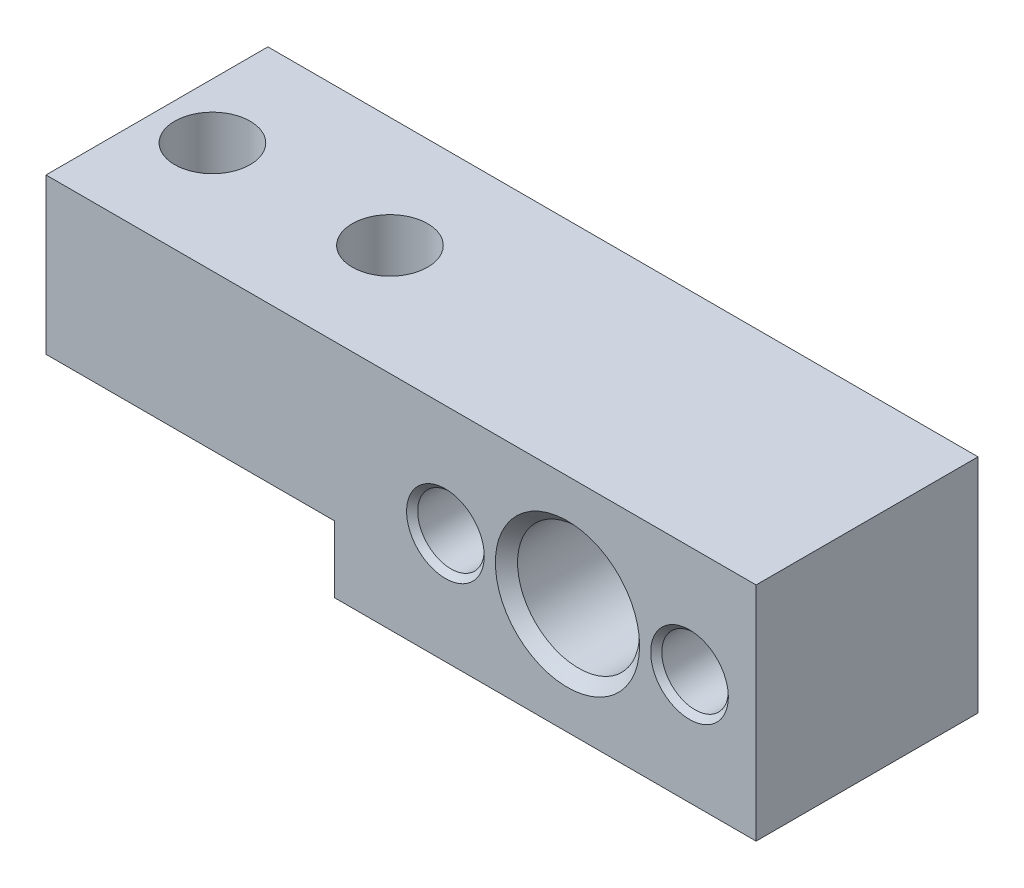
from build123d import *

# Parameters (mm, degrees)
ESQUISSE1_W             = 32
ESQUISSE1_H             = 10
EXTRUSION1_DEPTH        = 10
ESQUISSE2_W             = 13
ESQUISSE2_H             = 3
ENL_V_MAT_EXTRU_1_DEPTH = 20.519221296
ESQUISSE3_R             = 2.75
ESQUISSE3_R_2           = 1.5
ENL_V_MAT_EXTRU_2_DEPTH = 20.519221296
CHANFREIN1_SIZE         = 0.5
CHANFREIN2_SIZE         = 0.25
D_GAGEMENT_POUR_M31_D   = 3.4


with BuildPart() as part:
    # Esquisse1 → Extrusion1 (new body)
    with BuildSketch(Plane.XY):
        Rectangle(ESQUISSE1_W, ESQUISSE1_H)
    extrude(amount=EXTRUSION1_DEPTH)

    # Esquisse2 → Enl_v. mat.-Extru.1 (cut, through all)
    with BuildSketch(Plane.XY.offset(10)):
        with Locations((-9.5, -3.5)):
            Rectangle(ESQUISSE2_W, ESQUISSE2_H)
    extrude(amount=-ENL_V_MAT_EXTRU_1_DEPTH, mode=Mode.SUBTRACT)

    # Esquisse3 → Enl_v. mat.-Extru.2 (cut, through all)
    with BuildSketch(Plane.XY.offset(10)):
        with Locations((7.5, 0)):
            Circle(ESQUISSE3_R)
        with Locations((13, 0)):
            Circle(ESQUISSE3_R_2)
        with Locations((2, 0)):
            Circle(ESQUISSE3_R_2)
    extrude(amount=-ENL_V_MAT_EXTRU_2_DEPTH, mode=Mode.SUBTRACT)

    # Chanfrein1
    chanfrein1_edges = [part.edges().sort_by_distance(p)[0] for p in [
        (4.75, 0, 0),
        (4.75, 0, 10),
    ]]
    chamfer(chanfrein1_edges, length=CHANFREIN1_SIZE)

    # Chanfrein2
    chanfrein2_edges = [part.edges().sort_by_distance(p)[0] for p in [
        (0.5, 0, 0),
        (11.5, 0, 0),
        (0.5, 0, 10),
        (11.5, 0, 10),
    ]]
    chamfer(chanfrein2_edges, length=CHANFREIN2_SIZE)

    # D_gagement pour M31 (through all)
    with Locations(Plane(origin=(0, 5, 0), x_dir=(-1, 0, 0), z_dir=(0, 1, 0))):
        with Locations((13.5, 5), (5.5, 5)):
            Hole(D_GAGEMENT_POUR_M31_D / 2)


solid = part.part
